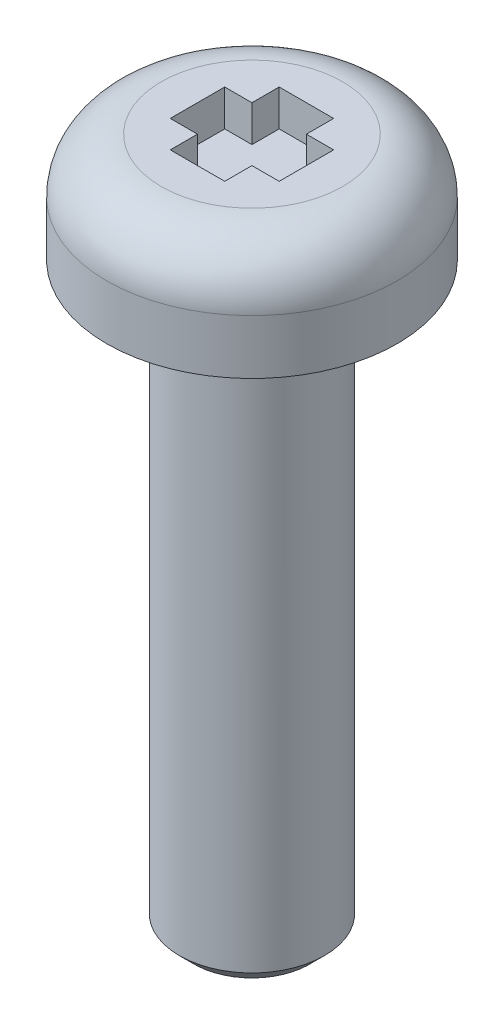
from build123d import *

# Parameters (mm, degrees)
SKETCH2_W               = 1.5
SKETCH2_H               = 3
CUT_EXTRUDE_THIN2_DEPTH = 1
CIRPATTERN1_COUNT       = 2
CIRPATTERN1_ANGLE       = 90
SKETCH3_R               = 2
BOSS_EXTRUDE1_DEPTH     = 16
FILLET1_R               = 0.4572
CHAMFER1_SIZE           = 0.4064


with BuildPart() as part:
    # Sketch1 → Base-Revolve (revolve)
    with BuildSketch(Plane.XY, mode=Mode.PRIVATE) as base_revolve_sk:
        with BuildLine():
            Line((4, 0), (0, 0))
            Line((0, 0), (0, 3))
            Line((0, 3), (2.5, 3))
            ThreePointArc((2.5, 3), (3.560660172, 2.560660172), (4, 1.5))
            Line((4, 1.5), (4, 0))
        make_face()
    revolve(base_revolve_sk.sketch.rotate(Axis((0, 11.592517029, 0), (0, -1, 0)), 90), axis=Axis((0, 11.592517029, 0), (0, -1, 0)))

    # Sketch2 → Cut-Extrude-Thin2 (cut)
    with BuildSketch(Plane(origin=(0, 3, 0), x_dir=(-1, 0, 0), z_dir=(0, 1, 0))):
        Rectangle(SKETCH2_W, SKETCH2_H)
    cut_extrude_thin2 = extrude(amount=-CUT_EXTRUDE_THIN2_DEPTH, mode=Mode.SUBTRACT)

    # CirPattern1: Cut-Extrude-Thin2 ×2 about axis
    cirpattern1_axis = Axis((0, 0, 0), (0, 1, 0))
    for i in range(1, CIRPATTERN1_COUNT):
        add(cut_extrude_thin2.rotate(cirpattern1_axis, i * CIRPATTERN1_ANGLE / (CIRPATTERN1_COUNT - 1)), mode=Mode.SUBTRACT)

    # Sketch3 → Boss-Extrude1 (add)
    with BuildSketch(Plane.XZ):
        with Locations(Location((0, 0, 0), (0, 0, 90))):
            Circle(SKETCH3_R)
    extrude(amount=BOSS_EXTRUDE1_DEPTH)

    # Fillet1
    fillet1_edges = [part.edges().sort_by_distance(p)[0] for p in [
        (0, 0, -2),
    ]]
    fillet(fillet1_edges, radius=FILLET1_R)

    # Chamfer1
    chamfer1_edges = [part.edges().sort_by_distance(p)[0] for p in [
        (0, -16, -2),
    ]]
    chamfer(chamfer1_edges, length=CHAMFER1_SIZE)


solid = part.part
